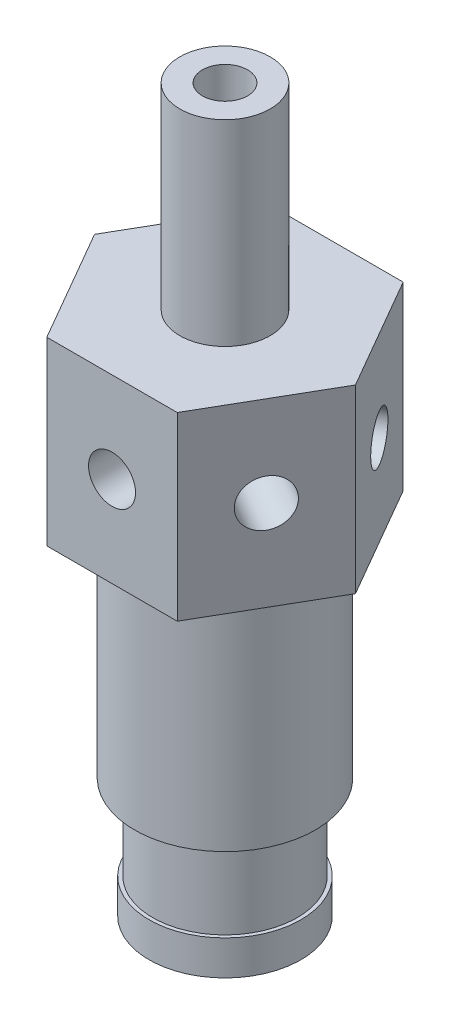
from build123d import *
from build123d.topology import SkipClean

# Parameters (mm, degrees)
SKETCH2_OUTSIDE_W       = 17.274
SKETCH2_OUTSIDE_H       = 17.274
CUT_EXTRUDE1_DEPTH      = 20.687884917
CUT_EXTRUDE2_REACH      = 29.293
CUT_EXTRUDE2_END_RADIUS = 1.5875
SKETCH3_R               = 0.8255
CIRPATTERN1_COUNT       = 6


with BuildPart() as part:
    # Sketch1 → Revolve1 (revolve)
    with BuildSketch(Plane.XY, mode=Mode.PRIVATE) as revolve1_sk:
        Polygon((-0.79375, 0), (-1.5875, 0), (-1.5875, 0.0508), (-2.667, 0.0508), (-2.667, 1.27), (-2.54, 1.27), (-2.54, 4), (-2.667, 4), (-2.667, 4.254), (-3.175, 4.254), (-3.175, 12.15), (-4.7625, 12.15), (-4.7625, 18.5), (-1.5875, 18.5), (-1.5875, 25.4), (-0.79375, 25.4), align=None)
    revolve(revolve1_sk.sketch.rotate(Axis((0, 0, 0), (0, 1, 0)), 270), axis=Axis((0, 0, 0), (0, 1, 0)))

    # Sketch2 outside → Cut-Extrude1 (cut, through all)
    with BuildSketch(Plane(origin=(0, 18.5, 0), x_dir=(1, 0, 0), z_dir=(0, 1, 0))):
        Rectangle(SKETCH2_OUTSIDE_W, SKETCH2_OUTSIDE_H)
        Polygon((4.582717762, 0), (2.291358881, 3.96875), (-2.291358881, 3.96875), (-4.582717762, 0), (-2.291358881, -3.96875), (2.291358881, -3.96875), align=None, mode=Mode.SUBTRACT)
    extrude(amount=-CUT_EXTRUDE1_DEPTH, mode=Mode.SUBTRACT)

    # Cut-Extrude2: up to this cylinder (the profile starts outside it)
    cut_extrude2_end = Plane(origin=(0, 15.325, 0), z_dir=(0, -1, 0)) * Cylinder(CUT_EXTRUDE2_END_RADIUS, 62.761, mode=Mode.PRIVATE)
    # Sketch3 → Cut-Extrude2 (cut, up to the surface)
    with BuildSketch(Plane(origin=(3.437038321, 0, -1.984375), x_dir=(-0.49999999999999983, 0, -0.8660254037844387), z_dir=(0.8660254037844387, 0, -0.49999999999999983)), mode=Mode.PRIVATE) as cut_extrude2_sk1:
        with Locations((0, 15.325)):
            Circle(SKETCH3_R)
    cut_extrude2_tool1 = extrude(cut_extrude2_sk1.sketch, amount=-CUT_EXTRUDE2_REACH, mode=Mode.PRIVATE) - cut_extrude2_end
    cut_extrude2 = cut_extrude2_tool1.solids().sort_by_distance((3.437038, 15.325, -1.984375))[0]
    add(cut_extrude2, mode=Mode.SUBTRACT)

    # CirPattern1: Cut-Extrude2 ×6 about axis
    with SkipClean():  # the faces are left unmerged after this step: merging them gives an invalid solid
        cirpattern1_axis = Axis((0, 0, 0), (0, -1, 0))
        for i in range(1, CIRPATTERN1_COUNT):
            add(cut_extrude2.rotate(cirpattern1_axis, i * 360 / CIRPATTERN1_COUNT), mode=Mode.SUBTRACT)


solid = part.part
